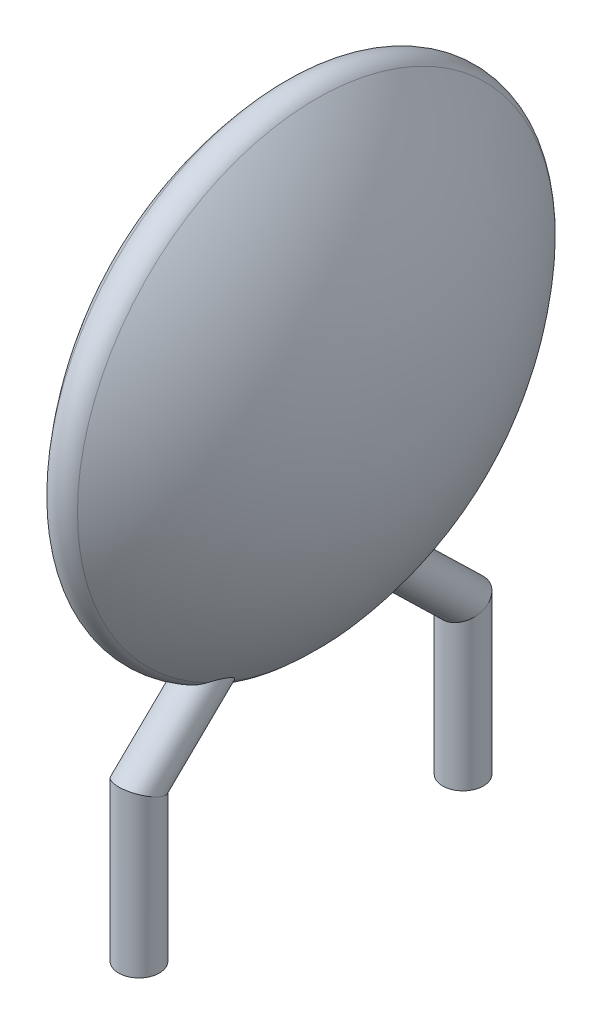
ISO-10303-21;
HEADER;
FILE_DESCRIPTION(('STEP AP214'),'2;1');
FILE_NAME('part.step','',(''),(''),'','','');
FILE_SCHEMA(('AUTOMOTIVE_DESIGN { 1 0 10303 214 1 1 1 1 }'));
ENDSEC;
DATA;
#1=APPLICATION_CONTEXT('core data for automotive mechanical design processes');
#2=APPLICATION_PROTOCOL_DEFINITION('international standard','automotive_design',2000,#1);
#3=PRODUCT_CONTEXT('',#1,'mechanical');
#4=PRODUCT('Part','Part','',(#3));
#5=PRODUCT_RELATED_PRODUCT_CATEGORY('part','',(#4));
#6=PRODUCT_DEFINITION_FORMATION('','',#4);
#7=PRODUCT_DEFINITION_CONTEXT('part definition',#1,'design');
#8=PRODUCT_DEFINITION('design','',#6,#7);
#9=PRODUCT_DEFINITION_SHAPE('','',#8);
#10=(LENGTH_UNIT() NAMED_UNIT(*) SI_UNIT(.MILLI.,.METRE.));
#11=(NAMED_UNIT(*) PLANE_ANGLE_UNIT() SI_UNIT($,.RADIAN.));
#12=(NAMED_UNIT(*) SI_UNIT($,.STERADIAN.) SOLID_ANGLE_UNIT());
#13=UNCERTAINTY_MEASURE_WITH_UNIT(LENGTH_MEASURE(1.E-05),#10,'distance_accuracy_value','');
#14=(GEOMETRIC_REPRESENTATION_CONTEXT(3) GLOBAL_UNCERTAINTY_ASSIGNED_CONTEXT((#13)) GLOBAL_UNIT_ASSIGNED_CONTEXT((#10,
#11,#12)) REPRESENTATION_CONTEXT('',''));
#15=CARTESIAN_POINT('',(0.,0.,0.));
#16=DIRECTION('',(0.,0.,1.));
#17=DIRECTION('',(1.,0.,0.));
#18=AXIS2_PLACEMENT_3D('',#15,#16,#17);
#19=CARTESIAN_POINT('',(0.,0.,0.));
#20=DIRECTION('',(-1.,0.,0.));
#21=DIRECTION('',(0.,0.,1.));
#22=AXIS2_PLACEMENT_3D('',#19,#20,#21);
#23=TOROIDAL_SURFACE('',#22,2.20793122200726,0.2);
#24=CARTESIAN_POINT('',(0.150141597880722,0.,0.));
#25=DIRECTION('',(-1.,0.,0.));
#26=DIRECTION('',(0.,0.,1.));
#27=AXIS2_PLACEMENT_3D('',#24,#25,#26);
#28=CIRCLE('',#27,2.34005805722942);
#29=CARTESIAN_POINT('',(0.150141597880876,-2.19487026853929,-0.811428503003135));
#30=VERTEX_POINT('',#29);
#31=CARTESIAN_POINT('',(0.150141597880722,-2.31765045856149,-0.32306046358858));
#32=VERTEX_POINT('',#31);
#33=EDGE_CURVE('E103',#30,#32,#28,.T.);
#34=ORIENTED_EDGE('',*,*,#33,.T.);
#35=CARTESIAN_POINT('',(1.01821764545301E-13,-2.31765045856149,0.653168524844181));
#36=CARTESIAN_POINT('',(0.00358224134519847,-2.31765045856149,0.653168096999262));
#37=CARTESIAN_POINT('',(0.00716594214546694,-2.31765045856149,0.652809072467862));
#38=CARTESIAN_POINT('',(0.0142016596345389,-2.31765045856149,0.651420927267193));
#39=CARTESIAN_POINT('',(0.0176534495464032,-2.31765045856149,0.650390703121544));
#40=CARTESIAN_POINT('',(0.025044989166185,-2.31765045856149,0.647497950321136));
#41=CARTESIAN_POINT('',(0.0289328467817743,-2.31765045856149,0.645505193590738));
#42=CARTESIAN_POINT('',(0.0363384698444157,-2.31765045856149,0.640926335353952));
#43=CARTESIAN_POINT('',(0.0398554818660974,-2.31765045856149,0.638339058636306));
#44=CARTESIAN_POINT('',(0.0488380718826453,-2.31765045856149,0.630827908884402));
#45=CARTESIAN_POINT('',(0.0539793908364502,-2.31765045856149,0.625521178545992));
#46=CARTESIAN_POINT('',(0.0634641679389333,-2.31765045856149,0.614245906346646));
#47=CARTESIAN_POINT('',(0.067805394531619,-2.31765045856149,0.60827558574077));
#48=CARTESIAN_POINT('',(0.077426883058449,-2.31765045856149,0.593551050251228));
#49=CARTESIAN_POINT('',(0.0824217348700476,-2.31765045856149,0.584612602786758));
#50=CARTESIAN_POINT('',(0.0915541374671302,-2.31765045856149,0.566301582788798));
#51=CARTESIAN_POINT('',(0.0956898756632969,-2.31765045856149,0.556928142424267));
#52=CARTESIAN_POINT('',(0.107155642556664,-2.31765045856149,0.52833750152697));
#53=CARTESIAN_POINT('',(0.113498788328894,-2.31765045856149,0.508729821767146));
#54=CARTESIAN_POINT('',(0.129093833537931,-2.31765045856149,0.452807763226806));
#55=CARTESIAN_POINT('',(0.136454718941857,-2.31765045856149,0.416000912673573));
#56=CARTESIAN_POINT('',(0.148232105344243,-2.31765045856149,0.341874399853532));
#57=CARTESIAN_POINT('',(0.152640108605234,-2.31765045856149,0.304553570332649));
#58=CARTESIAN_POINT('',(0.159510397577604,-2.31765045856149,0.229689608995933));
#59=CARTESIAN_POINT('',(0.161970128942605,-2.31765045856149,0.192146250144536));
#60=CARTESIAN_POINT('',(0.165474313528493,-2.31765045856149,0.117047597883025));
#61=CARTESIAN_POINT('',(0.166520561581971,-2.31765045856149,0.0794923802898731));
#62=CARTESIAN_POINT('',(0.167359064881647,-2.31765045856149,0.00910402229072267));
#63=CARTESIAN_POINT('',(0.167292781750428,-2.31765045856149,-0.0237275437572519));
#64=CARTESIAN_POINT('',(0.166232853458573,-2.31765045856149,-0.0893753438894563));
#65=CARTESIAN_POINT('',(0.165239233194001,-2.31765045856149,-0.122191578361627));
#66=CARTESIAN_POINT('',(0.162171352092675,-2.31765045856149,-0.187726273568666));
#67=CARTESIAN_POINT('',(0.160098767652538,-2.31765045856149,-0.220444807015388));
#68=CARTESIAN_POINT('',(0.154533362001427,-2.31765045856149,-0.285743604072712));
#69=CARTESIAN_POINT('',(0.151041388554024,-2.31765045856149,-0.318323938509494));
#70=CARTESIAN_POINT('',(0.142011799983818,-2.31765045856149,-0.383373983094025));
#71=CARTESIAN_POINT('',(0.136465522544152,-2.31765045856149,-0.415842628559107));
#72=CARTESIAN_POINT('',(0.125663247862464,-2.31765045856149,-0.464016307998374));
#73=CARTESIAN_POINT('',(0.121645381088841,-2.31765045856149,-0.479995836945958));
#74=CARTESIAN_POINT('',(0.112484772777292,-2.31765045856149,-0.511623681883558));
#75=CARTESIAN_POINT('',(0.107343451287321,-2.31765045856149,-0.527272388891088));
#76=CARTESIAN_POINT('',(0.0964396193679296,-2.31765045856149,-0.555404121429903));
#77=CARTESIAN_POINT('',(0.0909218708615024,-2.31765045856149,-0.567981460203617));
#78=CARTESIAN_POINT('',(0.0782918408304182,-2.31765045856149,-0.592282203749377));
#79=CARTESIAN_POINT('',(0.0711907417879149,-2.31765045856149,-0.604010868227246));
#80=CARTESIAN_POINT('',(0.0600732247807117,-2.31765045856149,-0.618347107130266));
#81=CARTESIAN_POINT('',(0.0571698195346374,-2.31765045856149,-0.621808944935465));
#82=CARTESIAN_POINT('',(0.0510287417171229,-2.31765045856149,-0.628436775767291));
#83=CARTESIAN_POINT('',(0.0477906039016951,-2.31765045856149,-0.631602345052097));
#84=CARTESIAN_POINT('',(0.0409023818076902,-2.31765045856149,-0.63753622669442));
#85=CARTESIAN_POINT('',(0.0372483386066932,-2.31765045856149,-0.640300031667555));
#86=CARTESIAN_POINT('',(0.0295326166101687,-2.31765045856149,-0.645186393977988));
#87=CARTESIAN_POINT('',(0.0254720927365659,-2.31765045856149,-0.647310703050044));
#88=CARTESIAN_POINT('',(0.0182532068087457,-2.31765045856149,-0.65016916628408));
#89=CARTESIAN_POINT('',(0.015184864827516,-2.31765045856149,-0.651128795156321));
#90=CARTESIAN_POINT('',(0.00893122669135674,-2.31765045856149,-0.652523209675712));
#91=CARTESIAN_POINT('',(0.00574606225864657,-2.31765045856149,-0.652958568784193));
#92=CARTESIAN_POINT('',(-0.000661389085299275,-2.31765045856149,-0.653259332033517));
#93=CARTESIAN_POINT('',(-0.00388375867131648,-2.31765045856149,-0.653123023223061));
#94=CARTESIAN_POINT('',(-0.0102559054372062,-2.31765045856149,-0.652292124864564));
#95=CARTESIAN_POINT('',(-0.0134056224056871,-2.31765045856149,-0.65159708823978));
#96=CARTESIAN_POINT('',(-0.0202341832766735,-2.31765045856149,-0.649508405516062));
#97=CARTESIAN_POINT('',(-0.0238756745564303,-2.31765045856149,-0.647994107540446));
#98=CARTESIAN_POINT('',(-0.0308660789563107,-2.31765045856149,-0.644399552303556));
#99=CARTESIAN_POINT('',(-0.0342144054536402,-2.31765045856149,-0.642318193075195));
#100=CARTESIAN_POINT('',(-0.0425400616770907,-2.31765045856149,-0.636363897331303));
#101=CARTESIAN_POINT('',(-0.0472831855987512,-2.31765045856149,-0.632167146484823));
#102=CARTESIAN_POINT('',(-0.0561067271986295,-2.31765045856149,-0.62313327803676));
#103=CARTESIAN_POINT('',(-0.0601853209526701,-2.31765045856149,-0.618294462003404));
#104=CARTESIAN_POINT('',(-0.073688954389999,-2.31765045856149,-0.600489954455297));
#105=CARTESIAN_POINT('',(-0.0816929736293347,-2.31765045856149,-0.586467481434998));
#106=CARTESIAN_POINT('',(-0.0957129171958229,-2.31765045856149,-0.557467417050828));
#107=CARTESIAN_POINT('',(-0.101716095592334,-2.31765045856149,-0.542484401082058));
#108=CARTESIAN_POINT('',(-0.115943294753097,-2.31765045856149,-0.501886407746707));
#109=CARTESIAN_POINT('',(-0.122972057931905,-2.31765045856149,-0.475855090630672));
#110=CARTESIAN_POINT('',(-0.1348313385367,-2.31765045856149,-0.423282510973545));
#111=CARTESIAN_POINT('',(-0.139655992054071,-2.31765045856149,-0.396740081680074));
#112=CARTESIAN_POINT('',(-0.147794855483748,-2.31765045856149,-0.343405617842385));
#113=CARTESIAN_POINT('',(-0.151107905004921,-2.31765045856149,-0.31661340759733));
#114=CARTESIAN_POINT('',(-0.15663657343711,-2.31765045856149,-0.262913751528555));
#115=CARTESIAN_POINT('',(-0.158851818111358,-2.31765045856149,-0.23600626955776));
#116=CARTESIAN_POINT('',(-0.163783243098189,-2.31765045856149,-0.162086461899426));
#117=CARTESIAN_POINT('',(-0.16564487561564,-2.31765045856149,-0.115017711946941));
#118=CARTESIAN_POINT('',(-0.167473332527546,-2.31765045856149,-0.0209526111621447));
#119=CARTESIAN_POINT('',(-0.167444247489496,-2.31765045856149,0.0260436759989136));
#120=CARTESIAN_POINT('',(-0.165780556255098,-2.31765045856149,0.105226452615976));
#121=CARTESIAN_POINT('',(-0.164653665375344,-2.31765045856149,0.137423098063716));
#122=CARTESIAN_POINT('',(-0.16131189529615,-2.31765045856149,0.201776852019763));
#123=CARTESIAN_POINT('',(-0.159096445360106,-2.31765045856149,0.233933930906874));
#124=CARTESIAN_POINT('',(-0.152156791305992,-2.31765045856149,0.310178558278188));
#125=CARTESIAN_POINT('',(-0.146803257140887,-2.31765045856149,0.354216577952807));
#126=CARTESIAN_POINT('',(-0.133870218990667,-2.31765045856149,0.428329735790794));
#127=CARTESIAN_POINT('',(-0.127458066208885,-2.31765045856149,0.458589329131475));
#128=CARTESIAN_POINT('',(-0.114864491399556,-2.31765045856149,0.503874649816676));
#129=CARTESIAN_POINT('',(-0.110038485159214,-2.31765045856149,0.519266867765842));
#130=CARTESIAN_POINT('',(-0.098961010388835,-2.31765045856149,0.549498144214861));
#131=CARTESIAN_POINT('',(-0.0927135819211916,-2.31765045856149,0.564338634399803));
#132=CARTESIAN_POINT('',(-0.0793841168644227,-2.31765045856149,0.590324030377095));
#133=CARTESIAN_POINT('',(-0.0726710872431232,-2.31765045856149,0.601644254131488));
#134=CARTESIAN_POINT('',(-0.0608805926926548,-2.31765045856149,0.61745662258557));
#135=CARTESIAN_POINT('',(-0.0566343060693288,-2.31765045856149,0.622558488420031));
#136=CARTESIAN_POINT('',(-0.0474159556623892,-2.31765045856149,0.632063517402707));
#137=CARTESIAN_POINT('',(-0.0424465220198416,-2.31765045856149,0.636469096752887));
#138=CARTESIAN_POINT('',(-0.034077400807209,-2.31765045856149,0.642393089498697));
#139=CARTESIAN_POINT('',(-0.030970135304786,-2.31765045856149,0.644321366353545));
#140=CARTESIAN_POINT('',(-0.0245020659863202,-2.31765045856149,0.647693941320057));
#141=CARTESIAN_POINT('',(-0.0211416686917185,-2.31765045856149,0.64913899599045));
#142=CARTESIAN_POINT('',(-0.0148299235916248,-2.31765045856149,0.651212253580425));
#143=CARTESIAN_POINT('',(-0.0119115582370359,-2.31765045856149,0.651939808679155));
#144=CARTESIAN_POINT('',(-0.00599577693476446,-2.31765045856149,0.652918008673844));
#145=CARTESIAN_POINT('',(-0.0029983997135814,-2.31765045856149,0.653168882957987));
#146=CARTESIAN_POINT('',(1.01821764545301E-13,-2.31765045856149,0.653168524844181));
#147=B_SPLINE_CURVE_WITH_KNOTS('',3,(#35,#36,#37,#38,#39,#40,#41,#42,#43,#44,#45,#46,#47,#48,
#49,#50,#51,#52,#53,#54,#55,#56,#57,#58,#59,#60,#61,#62,#63,#64,#65,#66,#67,#68,#69,#70,#71,#72,
#73,#74,#75,#76,#77,#78,#79,#80,#81,#82,#83,#84,#85,#86,#87,#88,#89,#90,#91,#92,#93,#94,#95,#96,
#97,#98,#99,#100,#101,#102,#103,#104,#105,#106,#107,#108,#109,#110,#111,#112,#113,#114,#115,
#116,#117,#118,#119,#120,#121,#122,#123,#124,#125,#126,#127,#128,#129,#130,#131,#132,#133,#134,
#135,#136,#137,#138,#139,#140,#141,#142,#143,#144,#145,#146),.UNSPECIFIED.,.T.,.F.,(4,2,2,2,2,2,
2,2,2,2,2,2,2,2,2,2,2,2,2,2,2,2,2,2,2,2,2,2,2,2,2,2,2,2,2,2,2,2,2,2,2,2,2,2,2,2,2,2,2,2,2,2,2,2,
2,4),(0.,0.0107326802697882,0.0214830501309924,0.0345147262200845,0.047572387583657,
0.0696142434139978,0.0917166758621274,0.122360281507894,0.15306789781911,0.214755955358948,
0.327119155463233,0.439804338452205,0.552637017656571,0.665326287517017,0.76380888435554,
0.862288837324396,0.960616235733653,1.05888499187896,1.15757292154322,1.2069788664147,
1.25632271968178,1.29747612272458,1.33834759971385,1.35188568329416,1.36544284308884,
1.37914197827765,1.39280323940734,1.40240903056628,1.4120043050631,1.42162835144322,
1.43126010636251,1.44302554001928,1.45481400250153,1.47370607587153,1.49264915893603,
1.54071662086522,1.58908468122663,1.669762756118,1.75065423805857,1.83160771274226,
1.91258876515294,2.05384944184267,2.19480451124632,2.29143770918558,2.38812162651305,
2.52107284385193,2.61370631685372,2.66205108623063,2.71026012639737,2.7495384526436,
2.7694060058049,2.78920302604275,2.80014278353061,2.81106533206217,2.82005310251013,
2.82903654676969),.UNSPECIFIED.);
#148=CARTESIAN_POINT('',(-0.150141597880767,-2.31765045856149,-0.323060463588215));
#149=VERTEX_POINT('',#148);
#150=EDGE_CURVE('E49',#32,#149,#147,.T.);
#151=ORIENTED_EDGE('',*,*,#150,.T.);
#152=CARTESIAN_POINT('',(-0.150141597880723,0.,0.));
#153=DIRECTION('',(-1.,0.,0.));
#154=DIRECTION('',(0.,0.,1.));
#155=AXIS2_PLACEMENT_3D('',#152,#153,#154);
#156=CIRCLE('',#155,2.34005805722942);
#157=CARTESIAN_POINT('',(-0.150141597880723,-2.19487026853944,-0.811428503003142));
#158=VERTEX_POINT('',#157);
#159=EDGE_CURVE('E115',#158,#149,#156,.T.);
#160=ORIENTED_EDGE('',*,*,#159,.F.);
#161=CARTESIAN_POINT('',(0.197950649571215,-2.07435108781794,-0.836032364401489));
#162=CARTESIAN_POINT('',(0.195909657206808,-2.09103306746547,-0.832756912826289));
#163=CARTESIAN_POINT('',(0.192278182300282,-2.10759376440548,-0.829445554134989));
#164=CARTESIAN_POINT('',(0.181882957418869,-2.13958360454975,-0.822956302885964));
#165=CARTESIAN_POINT('',(0.175141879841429,-2.15502001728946,-0.819777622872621));
#166=CARTESIAN_POINT('',(0.164370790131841,-2.17391593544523,-0.815837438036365));
#167=CARTESIAN_POINT('',(0.161759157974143,-2.1781767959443,-0.814945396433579));
#168=CARTESIAN_POINT('',(0.156258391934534,-2.18652681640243,-0.813191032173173));
#169=CARTESIAN_POINT('',(0.153369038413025,-2.19061583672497,-0.812328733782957));
#170=CARTESIAN_POINT('',(0.143567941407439,-2.20353689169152,-0.809594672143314));
#171=CARTESIAN_POINT('',(0.136103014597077,-2.21197688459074,-0.807794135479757));
#172=CARTESIAN_POINT('',(0.119869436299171,-2.22757652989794,-0.804445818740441));
#173=CARTESIAN_POINT('',(0.111099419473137,-2.23473482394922,-0.80289830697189));
#174=CARTESIAN_POINT('',(0.0923573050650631,-2.24748794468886,-0.800128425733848));
#175=CARTESIAN_POINT('',(0.082378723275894,-2.25307375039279,-0.79890793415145));
#176=CARTESIAN_POINT('',(0.0615269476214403,-2.26231521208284,-0.796882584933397));
#177=CARTESIAN_POINT('',(0.050654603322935,-2.2659726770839,-0.796077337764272));
#178=CARTESIAN_POINT('',(0.0294749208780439,-2.27087659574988,-0.794996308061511));
#179=CARTESIAN_POINT('',(0.0192161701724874,-2.27232370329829,-0.794676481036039));
#180=CARTESIAN_POINT('',(-0.00139864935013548,-2.27337808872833,-0.794443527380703));
#181=CARTESIAN_POINT('',(-0.0117546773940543,-2.27298610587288,-0.794530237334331));
#182=CARTESIAN_POINT('',(-0.0315169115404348,-2.27047717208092,-0.795084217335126));
#183=CARTESIAN_POINT('',(-0.0409395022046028,-2.26848054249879,-0.795524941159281));
#184=CARTESIAN_POINT('',(-0.0593235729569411,-2.26301247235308,-0.796728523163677));
#185=CARTESIAN_POINT('',(-0.0682849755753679,-2.25954078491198,-0.797491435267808));
#186=CARTESIAN_POINT('',(-0.0857957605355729,-2.25115214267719,-0.799327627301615));
#187=CARTESIAN_POINT('',(-0.0943251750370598,-2.2461955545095,-0.800409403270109));
#188=CARTESIAN_POINT('',(-0.110510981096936,-2.23508451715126,-0.802822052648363));
#189=CARTESIAN_POINT('',(-0.11816758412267,-2.22893035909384,-0.804152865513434));
#190=CARTESIAN_POINT('',(-0.134481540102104,-2.21379301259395,-0.807406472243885));
#191=CARTESIAN_POINT('',(-0.142839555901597,-2.20449648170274,-0.809391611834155));
#192=CARTESIAN_POINT('',(-0.15176075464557,-2.19273620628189,-0.811880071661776));
#193=CARTESIAN_POINT('',(-0.153149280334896,-2.19084419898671,-0.81227977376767));
#194=CARTESIAN_POINT('',(-0.168203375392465,-2.16964427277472,-0.816750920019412));
#195=CARTESIAN_POINT('',(-0.178794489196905,-2.14828213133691,-0.821188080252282));
#196=CARTESIAN_POINT('',(-0.186388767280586,-2.1256896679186,-0.825774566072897));
#197=B_SPLINE_CURVE_WITH_KNOTS('',3,(#161,#162,#163,#164,#165,#166,#167,#168,#169,#170,#171,
#172,#173,#174,#175,#176,#177,#178,#179,#180,#181,#182,#183,#184,#185,#186,#187,#188,#189,#190,
#191,#192,#193,#194,#195,#196),.UNSPECIFIED.,.F.,.F.,(4,2,2,2,2,2,2,2,2,2,2,2,2,2,2,2,2,4),(0.,
0.0514341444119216,0.102499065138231,0.117720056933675,0.132953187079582,0.167036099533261,
0.201154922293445,0.235465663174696,0.269744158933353,0.300673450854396,0.33159031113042,
0.360383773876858,0.389182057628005,0.418830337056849,0.44847141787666,0.48622222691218,
0.493363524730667,0.565387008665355),.UNSPECIFIED.);
#198=EDGE_CURVE('E146',#30,#158,#197,.T.);
#199=ORIENTED_EDGE('',*,*,#198,.F.);
#200=EDGE_LOOP('',(#34,#151,#160,#199));
#201=FACE_BOUND('',#200,.T.);
#202=ADVANCED_FACE('F29',(#201),#23,.T.);
#203=CARTESIAN_POINT('',(-0.150141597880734,-2.31765045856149,0.323060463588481));
#204=VERTEX_POINT('',#203);
#205=CARTESIAN_POINT('',(-0.1501415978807,-2.19487026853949,0.811428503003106));
#206=VERTEX_POINT('',#205);
#207=EDGE_CURVE('E98',#204,#206,#156,.T.);
#208=ORIENTED_EDGE('',*,*,#207,.F.);
#209=CARTESIAN_POINT('',(0.150141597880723,-2.31765045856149,0.323060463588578));
#210=VERTEX_POINT('',#209);
#211=EDGE_CURVE('E92',#204,#210,#147,.T.);
#212=ORIENTED_EDGE('',*,*,#211,.T.);
#213=CARTESIAN_POINT('',(0.150141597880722,-2.19487026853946,0.811428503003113));
#214=VERTEX_POINT('',#213);
#215=EDGE_CURVE('E56',#210,#214,#28,.T.);
#216=ORIENTED_EDGE('',*,*,#215,.T.);
#217=CARTESIAN_POINT('',(0.163199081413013,-2.17575015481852,0.815452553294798));
#218=CARTESIAN_POINT('',(0.159237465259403,-2.18223415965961,0.814095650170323));
#219=CARTESIAN_POINT('',(0.15494784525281,-2.188535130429,0.812769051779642));
#220=CARTESIAN_POINT('',(0.143563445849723,-2.20354182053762,0.809593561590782));
#221=CARTESIAN_POINT('',(0.136099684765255,-2.21198055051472,0.807793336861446));
#222=CARTESIAN_POINT('',(0.119867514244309,-2.22757791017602,0.804445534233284));
#223=CARTESIAN_POINT('',(0.111098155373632,-2.23473559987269,0.802898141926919));
#224=CARTESIAN_POINT('',(0.0923574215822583,-2.24748795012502,0.800128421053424));
#225=CARTESIAN_POINT('',(0.0823794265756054,-2.25307338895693,0.798908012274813));
#226=CARTESIAN_POINT('',(0.0615278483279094,-2.26231486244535,0.796882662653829));
#227=CARTESIAN_POINT('',(0.0506550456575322,-2.26597255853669,0.796077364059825));
#228=CARTESIAN_POINT('',(0.0294747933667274,-2.27087663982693,0.794996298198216));
#229=CARTESIAN_POINT('',(0.0192159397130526,-2.27232374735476,0.794676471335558));
#230=CARTESIAN_POINT('',(-0.00139888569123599,-2.2733780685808,0.794443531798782));
#231=CARTESIAN_POINT('',(-0.0117548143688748,-2.27298606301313,0.794530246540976));
#232=CARTESIAN_POINT('',(-0.0315166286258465,-2.27047723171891,0.795084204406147));
#233=CARTESIAN_POINT('',(-0.0409389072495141,-2.26848074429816,0.795524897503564));
#234=CARTESIAN_POINT('',(-0.0593231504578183,-2.26301257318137,0.796728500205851));
#235=CARTESIAN_POINT('',(-0.0682850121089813,-2.25954056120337,0.797491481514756));
#236=CARTESIAN_POINT('',(-0.0857966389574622,-2.25115193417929,0.79932767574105));
#237=CARTESIAN_POINT('',(-0.0943263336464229,-2.24619557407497,0.800409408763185));
#238=CARTESIAN_POINT('',(-0.110514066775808,-2.2350815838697,0.802822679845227));
#239=CARTESIAN_POINT('',(-0.118172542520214,-2.22892456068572,0.804154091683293));
#240=CARTESIAN_POINT('',(-0.129914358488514,-2.21803155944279,0.806495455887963));
#241=CARTESIAN_POINT('',(-0.134287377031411,-2.21358942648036,0.80744700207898));
#242=CARTESIAN_POINT('',(-0.142623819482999,-2.20435219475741,0.809417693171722));
#243=CARTESIAN_POINT('',(-0.146587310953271,-2.19955715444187,0.810436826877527));
#244=CARTESIAN_POINT('',(-0.159485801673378,-2.18255003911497,0.814035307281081));
#245=CARTESIAN_POINT('',(-0.16738890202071,-2.16957283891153,0.816754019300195));
#246=CARTESIAN_POINT('',(-0.180674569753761,-2.1423555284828,0.82238488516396));
#247=CARTESIAN_POINT('',(-0.186047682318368,-2.12811091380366,0.82529771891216));
#248=CARTESIAN_POINT('',(-0.1901069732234,-2.11357300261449,0.82822578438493));
#249=B_SPLINE_CURVE_WITH_KNOTS('',3,(#217,#218,#219,#220,#221,#222,#223,#224,#225,#226,#227,
#228,#229,#230,#231,#232,#233,#234,#235,#236,#237,#238,#239,#240,#241,#242,#243,#244,#245,#246,
#247,#248),.UNSPECIFIED.,.F.,.F.,(4,2,2,2,2,2,2,2,2,2,2,2,2,2,2,4),(0.,0.0231655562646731,
0.0572539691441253,0.0913672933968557,0.125676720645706,0.15995652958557,0.190886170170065,
0.221802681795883,0.250595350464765,0.279394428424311,0.309046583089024,0.338683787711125,
0.357578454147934,0.37646999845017,0.422483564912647,0.468667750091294),.UNSPECIFIED.);
#250=EDGE_CURVE('E166',#214,#206,#249,.T.);
#251=ORIENTED_EDGE('',*,*,#250,.T.);
#252=EDGE_LOOP('',(#208,#212,#216,#251));
#253=FACE_BOUND('',#252,.T.);
#254=ADVANCED_FACE('F97',(#253),#23,.T.);
#255=CARTESIAN_POINT('',(2.41228209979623,0.,0.0850871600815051));
#256=DIRECTION('',(0.,-1.,0.));
#257=DIRECTION('',(0.,0.,1.));
#258=AXIS2_PLACEMENT_3D('',#255,#256,#257);
#259=CIRCLE('',#258,3.41334278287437);
#260=TRIMMED_CURVE('',#259,(PARAMETER_VALUE(-1.59572671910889)),
(PARAMETER_VALUE(1.59572671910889)),.T.,.PARAMETER.);
#261=CARTESIAN_POINT('',(2.41228209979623,0.,0.));
#262=DIRECTION('',(-1.,0.,0.));
#263=AXIS1_PLACEMENT('',#261,#262);
#264=SURFACE_OF_REVOLUTION('',#260,#263);
#265=CARTESIAN_POINT('',(-1.,0.,0.));
#266=VERTEX_POINT('',#265);
#267=VERTEX_LOOP('',#266);
#268=FACE_BOUND('',#267,.T.);
#269=ORIENTED_EDGE('',*,*,#159,.T.);
#270=CARTESIAN_POINT('',(-0.169590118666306,-2.31765045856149,0.0229172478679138));
#271=CARTESIAN_POINT('',(-0.168300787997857,-2.31765045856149,0.173044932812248));
#272=CARTESIAN_POINT('',(-0.15437434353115,-2.31765045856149,0.323177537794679));
#273=CARTESIAN_POINT('',(-0.101480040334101,-2.31765045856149,0.619103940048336));
#274=CARTESIAN_POINT('',(-0.0624817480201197,-2.31765045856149,0.764892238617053));
#275=CARTESIAN_POINT('',(0.0395984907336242,-2.31765045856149,1.04752094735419));
#276=CARTESIAN_POINT('',(0.102638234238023,-2.31765045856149,1.18437654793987));
#277=CARTESIAN_POINT('',(0.251184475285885,-2.31765045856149,1.44525021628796));
#278=CARTESIAN_POINT('',(0.33668309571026,-2.31765045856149,1.56927276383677));
#279=CARTESIAN_POINT('',(0.526122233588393,-2.31765045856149,1.79869758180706));
#280=CARTESIAN_POINT('',(0.629715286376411,-2.31765045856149,1.90438675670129));
#281=CARTESIAN_POINT('',(0.853416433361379,-2.31765045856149,2.09655217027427));
#282=CARTESIAN_POINT('',(0.973523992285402,-2.31765045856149,2.18302903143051));
#283=CARTESIAN_POINT('',(1.2248791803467,-2.31765045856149,2.33299985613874));
#284=CARTESIAN_POINT('',(1.35593345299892,-2.31765045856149,2.39681804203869));
#285=CARTESIAN_POINT('',(1.62695076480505,-2.31765045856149,2.50135526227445));
#286=CARTESIAN_POINT('',(1.76691332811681,-2.31765045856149,2.54207552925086));
#287=CARTESIAN_POINT('',(2.05063921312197,-2.31765045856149,2.59898902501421));
#288=CARTESIAN_POINT('',(2.19436598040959,-2.31765045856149,2.61536462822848));
#289=CARTESIAN_POINT('',(2.48252386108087,-2.31765045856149,2.62368893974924));
#290=CARTESIAN_POINT('',(2.6269549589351,-2.31765045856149,2.61563818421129));
#291=CARTESIAN_POINT('',(2.91205179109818,-2.31765045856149,2.57539704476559));
#292=CARTESIAN_POINT('',(3.05272585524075,-2.31765045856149,2.54326562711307));
#293=CARTESIAN_POINT('',(3.32669343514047,-2.31765045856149,2.45587349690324));
#294=CARTESIAN_POINT('',(3.45998696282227,-2.31765045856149,2.40061282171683));
#295=CARTESIAN_POINT('',(3.7156323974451,-2.31765045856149,2.26848113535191));
#296=CARTESIAN_POINT('',(3.83796839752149,-2.31765045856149,2.19157935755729));
#297=CARTESIAN_POINT('',(4.06808639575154,-2.31765045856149,2.01844165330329));
#298=CARTESIAN_POINT('',(4.17586824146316,-2.31765045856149,1.92220552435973));
#299=CARTESIAN_POINT('',(4.37454694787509,-2.31765045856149,1.71255817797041));
#300=CARTESIAN_POINT('',(4.46533956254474,-2.31765045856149,1.59904820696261));
#301=CARTESIAN_POINT('',(4.62685199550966,-2.31765045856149,1.35855617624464));
#302=CARTESIAN_POINT('',(4.69757082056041,-2.31765045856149,1.2315734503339));
#303=CARTESIAN_POINT('',(4.81794566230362,-2.31765045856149,0.966056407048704));
#304=CARTESIAN_POINT('',(4.86732443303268,-2.31765045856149,0.827396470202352));
#305=CARTESIAN_POINT('',(4.94257722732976,-2.31765045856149,0.543834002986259));
#306=CARTESIAN_POINT('',(4.96844778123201,-2.31765045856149,0.398930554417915));
#307=CARTESIAN_POINT('',(4.99639432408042,-2.31765045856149,0.104154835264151));
#308=CARTESIAN_POINT('',(4.99802443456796,-2.31765045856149,-0.0457598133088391));
#309=CARTESIAN_POINT('',(4.97630708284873,-2.31765045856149,-0.34377550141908));
#310=CARTESIAN_POINT('',(4.95295863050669,-2.31765045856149,-0.491876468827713));
#311=CARTESIAN_POINT('',(4.88151006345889,-2.31765045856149,-0.783166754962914));
#312=CARTESIAN_POINT('',(4.83322756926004,-2.31765045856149,-0.926311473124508));
#313=CARTESIAN_POINT('',(4.7129653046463,-2.31765045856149,-1.20227800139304));
#314=CARTESIAN_POINT('',(4.64098757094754,-2.31765045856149,-1.33510069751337));
#315=CARTESIAN_POINT('',(4.47643729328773,-2.31765045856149,-1.58457513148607));
#316=CARTESIAN_POINT('',(4.38417559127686,-2.31765045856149,-1.70143183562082));
#317=CARTESIAN_POINT('',(4.18103026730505,-2.31765045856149,-1.91765422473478));
#318=CARTESIAN_POINT('',(4.07014808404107,-2.31765045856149,-2.01702125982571));
#319=CARTESIAN_POINT('',(3.83498147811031,-2.31765045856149,-2.193696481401));
#320=CARTESIAN_POINT('',(3.71095783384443,-2.31765045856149,-2.27135192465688));
#321=CARTESIAN_POINT('',(3.45153698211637,-2.31765045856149,-2.4045022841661));
#322=CARTESIAN_POINT('',(3.31614048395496,-2.31765045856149,-2.45999858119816));
#323=CARTESIAN_POINT('',(3.03922867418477,-2.31765045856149,-2.54674721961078));
#324=CARTESIAN_POINT('',(2.89778486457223,-2.31765045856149,-2.57822794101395));
#325=CARTESIAN_POINT('',(2.61161522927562,-2.31765045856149,-2.61689600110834));
#326=CARTESIAN_POINT('',(2.46688949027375,-2.31765045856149,-2.62408398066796));
#327=CARTESIAN_POINT('',(2.17885047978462,-2.31765045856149,-2.61397468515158));
#328=CARTESIAN_POINT('',(2.03553392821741,-2.31765045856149,-2.59677054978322));
#329=CARTESIAN_POINT('',(1.7538238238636,-2.31765045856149,-2.53854949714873));
#330=CARTESIAN_POINT('',(1.61543024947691,-2.31765045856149,-2.49753268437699));
#331=CARTESIAN_POINT('',(1.34744219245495,-2.31765045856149,-2.3928733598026));
#332=CARTESIAN_POINT('',(1.21785000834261,-2.31765045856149,-2.32922496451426));
#333=CARTESIAN_POINT('',(0.97113749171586,-2.31765045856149,-2.18116647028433));
#334=CARTESIAN_POINT('',(0.854016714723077,-2.31765045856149,-2.0967571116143));
#335=CARTESIAN_POINT('',(0.634996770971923,-2.31765045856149,-1.90922684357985));
#336=CARTESIAN_POINT('',(0.533164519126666,-2.31765045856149,-1.80602781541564));
#337=CARTESIAN_POINT('',(0.348039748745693,-2.31765045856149,-1.58412114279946));
#338=CARTESIAN_POINT('',(0.264752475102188,-2.31765045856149,-1.46540912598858));
#339=CARTESIAN_POINT('',(0.118103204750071,-2.31765045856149,-1.21455522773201));
#340=CARTESIAN_POINT('',(0.054965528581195,-2.31765045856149,-1.08228244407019));
#341=CARTESIAN_POINT('',(-0.0485662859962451,-2.31765045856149,-0.809241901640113));
#342=CARTESIAN_POINT('',(-0.0889846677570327,-2.31765045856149,-0.668483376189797));
#343=CARTESIAN_POINT('',(-0.135699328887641,-2.31765045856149,-0.435267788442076));
#344=CARTESIAN_POINT('',(-0.149084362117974,-2.31765045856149,-0.344167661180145));
#345=CARTESIAN_POINT('',(-0.16642496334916,-2.31765045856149,-0.161073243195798));
#346=CARTESIAN_POINT('',(-0.170380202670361,-2.31765045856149,-0.0690789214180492));
#347=CARTESIAN_POINT('',(-0.169590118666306,-2.31765045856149,0.0229172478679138));
#348=B_SPLINE_CURVE_WITH_KNOTS('',3,(#270,#271,#272,#273,#274,#275,#276,#277,#278,#279,#280,
#281,#282,#283,#284,#285,#286,#287,#288,#289,#290,#291,#292,#293,#294,#295,#296,#297,#298,#299,
#300,#301,#302,#303,#304,#305,#306,#307,#308,#309,#310,#311,#312,#313,#314,#315,#316,#317,#318,
#319,#320,#321,#322,#323,#324,#325,#326,#327,#328,#329,#330,#331,#332,#333,#334,#335,#336,#337,
#338,#339,#340,#341,#342,#343,#344,#345,#346,#347),.UNSPECIFIED.,.T.,.F.,(4,2,2,2,2,2,2,2,2,2,2,
2,2,2,2,2,2,2,2,2,2,2,2,2,2,2,2,2,2,2,2,2,2,2,2,2,2,2,4),(0.,0.450064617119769,
0.900676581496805,1.35050114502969,1.80016814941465,2.24199646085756,2.68381045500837,
3.11902028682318,3.55420689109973,3.98611663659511,4.41801690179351,4.84886301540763,
5.27970843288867,5.71116949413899,6.14263507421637,6.57666703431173,7.01072046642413,
7.45025488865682,7.88985417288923,8.33752964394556,8.78522286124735,9.23623810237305,
9.68721458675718,10.1317099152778,10.5761709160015,11.0130529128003,11.4499076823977,
11.8825544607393,12.3151898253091,12.746177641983,13.1771635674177,13.6082616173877,
14.0393442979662,14.472261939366,14.905301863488,15.3430069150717,15.7802440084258,
16.0560277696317,16.3318211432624),.UNSPECIFIED.);
#349=EDGE_CURVE('E225',#149,#204,#348,.T.);
#350=ORIENTED_EDGE('',*,*,#349,.T.);
#351=ORIENTED_EDGE('',*,*,#207,.T.);
#352=CARTESIAN_POINT('',(-0.046930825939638,-2.30537718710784,0.835749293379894));
#353=CARTESIAN_POINT('',(-0.0584511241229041,-2.29504302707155,0.829151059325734));
#354=CARTESIAN_POINT('',(-0.0700980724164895,-2.28405826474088,0.823408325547));
#355=CARTESIAN_POINT('',(-0.093374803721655,-2.2608216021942,0.814409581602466));
#356=CARTESIAN_POINT('',(-0.105002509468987,-2.2485554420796,0.81118591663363));
#357=CARTESIAN_POINT('',(-0.122178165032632,-2.22922679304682,0.808930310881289));
#358=CARTESIAN_POINT('',(-0.127946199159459,-2.22251741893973,0.808625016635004));
#359=CARTESIAN_POINT('',(-0.139194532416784,-2.20892680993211,0.80912477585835));
#360=CARTESIAN_POINT('',(-0.14467574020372,-2.20204623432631,0.809926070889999));
#361=CARTESIAN_POINT('',(-0.154486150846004,-2.18916669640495,0.812622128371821));
#362=CARTESIAN_POINT('',(-0.158870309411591,-2.18317607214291,0.81435207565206));
#363=CARTESIAN_POINT('',(-0.167180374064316,-2.17127329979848,0.818884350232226));
#364=CARTESIAN_POINT('',(-0.17110631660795,-2.1653611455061,0.821686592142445));
#365=CARTESIAN_POINT('',(-0.178364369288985,-2.15375385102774,0.828441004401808));
#366=CARTESIAN_POINT('',(-0.181692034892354,-2.14806056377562,0.83240124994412));
#367=CARTESIAN_POINT('',(-0.187564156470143,-2.13715147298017,0.841409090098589));
#368=CARTESIAN_POINT('',(-0.190109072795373,-2.13193539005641,0.846456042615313));
#369=CARTESIAN_POINT('',(-0.194171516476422,-2.12252517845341,0.857051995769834));
#370=CARTESIAN_POINT('',(-0.195751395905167,-2.11828388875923,0.862535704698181));
#371=CARTESIAN_POINT('',(-0.198164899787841,-2.11044419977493,0.874092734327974));
#372=CARTESIAN_POINT('',(-0.198998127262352,-2.10684614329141,0.880166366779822));
#373=CARTESIAN_POINT('',(-0.200116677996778,-2.09929612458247,0.894659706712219));
#374=CARTESIAN_POINT('',(-0.200151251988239,-2.09558168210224,0.903221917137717));
#375=CARTESIAN_POINT('',(-0.199196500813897,-2.08921235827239,0.92067677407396));
#376=CARTESIAN_POINT('',(-0.198204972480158,-2.08655977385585,0.929570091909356));
#377=CARTESIAN_POINT('',(-0.194722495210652,-2.08117370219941,0.951587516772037));
#378=CARTESIAN_POINT('',(-0.191749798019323,-2.07897167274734,0.96476354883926));
#379=CARTESIAN_POINT('',(-0.184446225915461,-2.0761699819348,0.990887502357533));
#380=CARTESIAN_POINT('',(-0.180113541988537,-2.07557246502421,1.00383509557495));
#381=CARTESIAN_POINT('',(-0.167911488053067,-2.07570455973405,1.0358098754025));
#382=CARTESIAN_POINT('',(-0.159364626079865,-2.07726485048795,1.05457575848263));
#383=CARTESIAN_POINT('',(-0.143133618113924,-2.08193276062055,1.0857580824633));
#384=CARTESIAN_POINT('',(-0.135868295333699,-2.08449080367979,1.09849133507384));
#385=CARTESIAN_POINT('',(-0.120546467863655,-2.09067997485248,1.12320871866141));
#386=CARTESIAN_POINT('',(-0.112489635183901,-2.09431154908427,1.13519253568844));
#387=CARTESIAN_POINT('',(-0.104101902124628,-2.09841516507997,1.14676768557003));
#388=B_SPLINE_CURVE_WITH_KNOTS('',3,(#352,#353,#354,#355,#356,#357,#358,#359,#360,#361,#362,
#363,#364,#365,#366,#367,#368,#369,#370,#371,#372,#373,#374,#375,#376,#377,#378,#379,#380,#381,
#382,#383,#384,#385,#386,#387),.UNSPECIFIED.,.F.,.F.,(4,2,2,2,2,2,2,2,2,2,2,2,2,2,2,2,2,4),(0.,
0.0506858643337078,0.102012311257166,0.128510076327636,0.15491806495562,0.17770874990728,
0.200497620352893,0.223449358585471,0.246387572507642,0.267619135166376,0.288861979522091,
0.316706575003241,0.344611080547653,0.385438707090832,0.426320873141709,0.488019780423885,
0.532596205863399,0.577191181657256),.UNSPECIFIED.);
#389=CARTESIAN_POINT('',(-0.150141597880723,-2.07991746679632,1.0722942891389));
#390=VERTEX_POINT('',#389);
#391=EDGE_CURVE('E171',#206,#390,#388,.T.);
#392=ORIENTED_EDGE('',*,*,#391,.T.);
#393=CARTESIAN_POINT('',(-0.150141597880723,-2.07991746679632,-1.0722942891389));
#394=VERTEX_POINT('',#393);
#395=EDGE_CURVE('E106',#390,#394,#156,.T.);
#396=ORIENTED_EDGE('',*,*,#395,.T.);
#397=CARTESIAN_POINT('',(-0.046930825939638,-2.30537718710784,-0.835749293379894));
#398=CARTESIAN_POINT('',(-0.0584511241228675,-2.29504302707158,-0.829151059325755));
#399=CARTESIAN_POINT('',(-0.0700980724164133,-2.28405826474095,-0.823408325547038));
#400=CARTESIAN_POINT('',(-0.0933748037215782,-2.26082160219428,-0.814409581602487));
#401=CARTESIAN_POINT('',(-0.105002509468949,-2.24855544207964,-0.811185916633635));
#402=CARTESIAN_POINT('',(-0.122178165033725,-2.22922679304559,-0.808930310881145));
#403=CARTESIAN_POINT('',(-0.127946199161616,-2.22251741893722,-0.808625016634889));
#404=CARTESIAN_POINT('',(-0.13919453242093,-2.208926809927,-0.809124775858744));
#405=CARTESIAN_POINT('',(-0.144675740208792,-2.20204623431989,-0.809926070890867));
#406=CARTESIAN_POINT('',(-0.154486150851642,-2.18916669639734,-0.812622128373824));
#407=CARTESIAN_POINT('',(-0.158870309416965,-2.18317607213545,-0.814352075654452));
#408=CARTESIAN_POINT('',(-0.16718037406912,-2.17127329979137,-0.818884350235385));
#409=CARTESIAN_POINT('',(-0.171106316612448,-2.16536114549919,-0.821686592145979));
#410=CARTESIAN_POINT('',(-0.178364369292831,-2.15375385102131,-0.828441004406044));
#411=CARTESIAN_POINT('',(-0.181692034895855,-2.14806056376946,-0.832401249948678));
#412=CARTESIAN_POINT('',(-0.187564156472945,-2.13715147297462,-0.841409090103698));
#413=CARTESIAN_POINT('',(-0.190109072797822,-2.13193539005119,-0.846456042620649));
#414=CARTESIAN_POINT('',(-0.194171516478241,-2.12252517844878,-0.857051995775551));
#415=CARTESIAN_POINT('',(-0.195751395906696,-2.11828388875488,-0.862535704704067));
#416=CARTESIAN_POINT('',(-0.198164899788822,-2.11044419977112,-0.874092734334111));
#417=CARTESIAN_POINT('',(-0.198998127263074,-2.10684614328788,-0.880166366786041));
#418=CARTESIAN_POINT('',(-0.200116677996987,-2.09929612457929,-0.894659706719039));
#419=CARTESIAN_POINT('',(-0.200151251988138,-2.0955816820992,-0.903221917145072));
#420=CARTESIAN_POINT('',(-0.199196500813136,-2.08921235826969,-0.920676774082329));
#421=CARTESIAN_POINT('',(-0.198204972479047,-2.08655977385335,-0.929570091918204));
#422=CARTESIAN_POINT('',(-0.194722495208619,-2.0811737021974,-0.951587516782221));
#423=CARTESIAN_POINT('',(-0.191749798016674,-2.07897167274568,-0.964763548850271));
#424=CARTESIAN_POINT('',(-0.184446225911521,-2.07616998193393,-0.990887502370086));
#425=CARTESIAN_POINT('',(-0.180113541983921,-2.07557246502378,-1.00383509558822));
#426=CARTESIAN_POINT('',(-0.167911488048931,-2.07570455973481,-1.03580987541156));
#427=CARTESIAN_POINT('',(-0.159364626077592,-2.0772648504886,-1.054575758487));
#428=CARTESIAN_POINT('',(-0.143133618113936,-2.08193276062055,-1.08575808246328));
#429=CARTESIAN_POINT('',(-0.135868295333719,-2.08449080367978,-1.09849133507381));
#430=CARTESIAN_POINT('',(-0.120546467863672,-2.09067997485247,-1.12320871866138));
#431=CARTESIAN_POINT('',(-0.112489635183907,-2.09431154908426,-1.13519253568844));
#432=CARTESIAN_POINT('',(-0.104101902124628,-2.09841516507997,-1.14676768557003));
#433=B_SPLINE_CURVE_WITH_KNOTS('',3,(#397,#398,#399,#400,#401,#402,#403,#404,#405,#406,#407,
#408,#409,#410,#411,#412,#413,#414,#415,#416,#417,#418,#419,#420,#421,#422,#423,#424,#425,#426,
#427,#428,#429,#430,#431,#432),.UNSPECIFIED.,.F.,.F.,(4,2,2,2,2,2,2,2,2,2,2,2,2,2,2,2,2,4),(0.,
0.0506858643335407,0.102012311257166,0.128510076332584,0.154918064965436,0.177708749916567,
0.200497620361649,0.223449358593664,0.24638757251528,0.267619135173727,0.288861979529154,
0.316706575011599,0.344611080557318,0.38543870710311,0.426320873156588,0.488019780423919,
0.532596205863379,0.577191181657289),.UNSPECIFIED.);
#434=EDGE_CURVE('E107',#158,#394,#433,.T.);
#435=ORIENTED_EDGE('',*,*,#434,.F.);
#436=EDGE_LOOP('',(#269,#350,#351,#392,#396,#435));
#437=FACE_BOUND('',#436,.T.);
#438=ADVANCED_FACE('F31',(#268,#437),#264,.T.);
#439=ORIENTED_EDGE('',*,*,#395,.F.);
#440=CARTESIAN_POINT('',(-0.2,-2.040853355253,0.842542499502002));
#441=CARTESIAN_POINT('',(-0.199999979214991,-2.04103905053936,0.843508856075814));
#442=CARTESIAN_POINT('',(-0.199997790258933,-2.04122448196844,0.844475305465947));
#443=CARTESIAN_POINT('',(-0.199857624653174,-2.04716736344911,0.875496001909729));
#444=CARTESIAN_POINT('',(-0.197615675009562,-2.05266833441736,0.905628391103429));
#445=CARTESIAN_POINT('',(-0.188320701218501,-2.06304658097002,0.96527981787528));
#446=CARTESIAN_POINT('',(-0.181276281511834,-2.06792495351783,0.994799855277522));
#447=CARTESIAN_POINT('',(-0.168291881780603,-2.0737256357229,1.03161062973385));
#448=CARTESIAN_POINT('',(-0.165105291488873,-2.07500208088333,1.03983306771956));
#449=CARTESIAN_POINT('',(-0.158163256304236,-2.07748545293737,1.05605681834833));
#450=CARTESIAN_POINT('',(-0.154407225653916,-2.07869230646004,1.06405789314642));
#451=CARTESIAN_POINT('',(-0.143878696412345,-2.08171654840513,1.08438878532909));
#452=CARTESIAN_POINT('',(-0.136633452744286,-2.08347433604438,1.0964892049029));
#453=CARTESIAN_POINT('',(-0.120329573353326,-2.08674345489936,1.11945714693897));
#454=CARTESIAN_POINT('',(-0.111274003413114,-2.08825519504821,1.1303267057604));
#455=CARTESIAN_POINT('',(-0.0949573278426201,-2.09043981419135,1.14630679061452));
#456=CARTESIAN_POINT('',(-0.0883195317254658,-2.09121331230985,1.15203737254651));
#457=CARTESIAN_POINT('',(-0.0742482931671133,-2.09260568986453,1.162448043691));
#458=CARTESIAN_POINT('',(-0.0668160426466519,-2.09322479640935,1.16712967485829));
#459=CARTESIAN_POINT('',(-0.0525123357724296,-2.0941875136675,1.17445829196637));
#460=CARTESIAN_POINT('',(-0.0457504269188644,-2.09455971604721,1.17731346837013));
#461=CARTESIAN_POINT('',(-0.031839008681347,-2.09515135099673,1.1818675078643));
#462=CARTESIAN_POINT('',(-0.0246897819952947,-2.09537089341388,1.18356720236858));
#463=CARTESIAN_POINT('',(-0.0101604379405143,-2.09564242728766,1.1856711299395));
#464=CARTESIAN_POINT('',(-0.00277936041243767,-2.09569359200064,1.18606897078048));
#465=CARTESIAN_POINT('',(0.0119303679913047,-2.09562185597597,1.18551226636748));
#466=CARTESIAN_POINT('',(0.0192590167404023,-2.09549894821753,1.18455766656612));
#467=CARTESIAN_POINT('',(0.0330773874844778,-2.09510455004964,1.18150838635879));
#468=CARTESIAN_POINT('',(0.0395884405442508,-2.09484512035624,1.17950631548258));
#469=CARTESIAN_POINT('',(0.0522345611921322,-2.0942010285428,1.17456501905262));
#470=CARTESIAN_POINT('',(0.0583694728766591,-2.09381631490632,1.17162540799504));
#471=CARTESIAN_POINT('',(0.0729219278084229,-2.09273533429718,1.16342682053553));
#472=CARTESIAN_POINT('',(0.0810844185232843,-2.09197724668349,1.15772375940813));
#473=CARTESIAN_POINT('',(0.0963892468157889,-2.09027712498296,1.14510712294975));
#474=CARTESIAN_POINT('',(0.103529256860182,-2.08933468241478,1.13819086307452));
#475=CARTESIAN_POINT('',(0.118192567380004,-2.08709498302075,1.1219999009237));
#476=CARTESIAN_POINT('',(0.125495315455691,-2.08576458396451,1.11253219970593));
#477=CARTESIAN_POINT('',(0.138833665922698,-2.08293326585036,1.09277110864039));
#478=CARTESIAN_POINT('',(0.144868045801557,-2.08143218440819,1.08247693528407));
#479=CARTESIAN_POINT('',(0.154734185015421,-2.07859853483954,1.06342763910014));
#480=CARTESIAN_POINT('',(0.158765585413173,-2.07729123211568,1.05477006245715));
#481=CARTESIAN_POINT('',(0.166153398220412,-2.07460075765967,1.0372337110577));
#482=CARTESIAN_POINT('',(0.169513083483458,-2.07321799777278,1.0283562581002));
#483=CARTESIAN_POINT('',(0.172580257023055,-2.07179868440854,1.01939081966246));
#484=B_SPLINE_CURVE_WITH_KNOTS('',3,(#440,#441,#442,#443,#444,#445,#446,#447,#448,#449,#450,
#451,#452,#453,#454,#455,#456,#457,#458,#459,#460,#461,#462,#463,#464,#465,#466,#467,#468,#469,
#470,#471,#472,#473,#474,#475,#476,#477,#478,#479,#480,#481,#482,#483),.UNSPECIFIED.,.F.,.F.,(4,
2,2,2,2,2,2,2,2,2,2,2,2,2,2,2,2,2,2,2,2,4),(0.,0.00295222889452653,0.094751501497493,
0.186386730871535,0.213100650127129,0.239842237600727,0.282351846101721,0.324790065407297,
0.351121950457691,0.377414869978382,0.399373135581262,0.421315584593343,0.443365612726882,
0.465416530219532,0.485783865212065,0.506159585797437,0.535949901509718,0.565806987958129,
0.601773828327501,0.637775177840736,0.666666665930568,0.695413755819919),.UNSPECIFIED.);
#485=CARTESIAN_POINT('',(0.150141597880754,-2.07991746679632,1.07229428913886));
#486=VERTEX_POINT('',#485);
#487=EDGE_CURVE('E160',#390,#486,#484,.T.);
#488=ORIENTED_EDGE('',*,*,#487,.T.);
#489=CARTESIAN_POINT('',(0.150141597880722,-2.07991746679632,-1.0722942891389));
#490=VERTEX_POINT('',#489);
#491=EDGE_CURVE('E104',#486,#490,#28,.T.);
#492=ORIENTED_EDGE('',*,*,#491,.T.);
#493=CARTESIAN_POINT('',(-0.2,-2.040853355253,-0.842542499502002));
#494=CARTESIAN_POINT('',(-0.199999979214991,-2.04103905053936,-0.843508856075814));
#495=CARTESIAN_POINT('',(-0.199997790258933,-2.04122448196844,-0.844475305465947));
#496=CARTESIAN_POINT('',(-0.199857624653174,-2.04716736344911,-0.875496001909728));
#497=CARTESIAN_POINT('',(-0.19761567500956,-2.05266833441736,-0.905628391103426));
#498=CARTESIAN_POINT('',(-0.188320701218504,-2.06304658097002,-0.965279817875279));
#499=CARTESIAN_POINT('',(-0.181276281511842,-2.06792495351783,-0.994799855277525));
#500=CARTESIAN_POINT('',(-0.168291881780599,-2.0737256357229,-1.03161062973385));
#501=CARTESIAN_POINT('',(-0.165105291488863,-2.07500208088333,-1.03983306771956));
#502=CARTESIAN_POINT('',(-0.158163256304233,-2.07748545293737,-1.05605681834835));
#503=CARTESIAN_POINT('',(-0.154407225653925,-2.07869230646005,-1.06405789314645));
#504=CARTESIAN_POINT('',(-0.143878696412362,-2.08171654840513,-1.08438878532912));
#505=CARTESIAN_POINT('',(-0.136633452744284,-2.08347433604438,-1.09648920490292));
#506=CARTESIAN_POINT('',(-0.120329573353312,-2.08674345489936,-1.11945714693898));
#507=CARTESIAN_POINT('',(-0.111274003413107,-2.08825519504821,-1.1303267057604));
#508=CARTESIAN_POINT('',(-0.0949573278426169,-2.09043981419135,-1.14630679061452));
#509=CARTESIAN_POINT('',(-0.0883195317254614,-2.09121331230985,-1.15203737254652));
#510=CARTESIAN_POINT('',(-0.0742482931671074,-2.09260568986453,-1.162448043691));
#511=CARTESIAN_POINT('',(-0.0668160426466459,-2.09322479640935,-1.16712967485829));
#512=CARTESIAN_POINT('',(-0.0525123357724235,-2.0941875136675,-1.17445829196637));
#513=CARTESIAN_POINT('',(-0.0457504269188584,-2.09455971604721,-1.17731346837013));
#514=CARTESIAN_POINT('',(-0.0318390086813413,-2.09515135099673,-1.18186750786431));
#515=CARTESIAN_POINT('',(-0.0246897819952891,-2.09537089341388,-1.18356720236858));
#516=CARTESIAN_POINT('',(-0.010160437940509,-2.09564242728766,-1.1856711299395));
#517=CARTESIAN_POINT('',(-0.00277936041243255,-2.09569359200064,-1.18606897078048));
#518=CARTESIAN_POINT('',(0.0119303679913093,-2.09562185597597,-1.18551226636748));
#519=CARTESIAN_POINT('',(0.0192590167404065,-2.09549894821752,-1.18455766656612));
#520=CARTESIAN_POINT('',(0.0330773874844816,-2.09510455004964,-1.18150838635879));
#521=CARTESIAN_POINT('',(0.0395884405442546,-2.09484512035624,-1.17950631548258));
#522=CARTESIAN_POINT('',(0.0522345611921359,-2.0942010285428,-1.17456501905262));
#523=CARTESIAN_POINT('',(0.0583694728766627,-2.09381631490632,-1.17162540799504));
#524=CARTESIAN_POINT('',(0.0729219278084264,-2.09273533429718,-1.16342682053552));
#525=CARTESIAN_POINT('',(0.0810844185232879,-2.09197724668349,-1.15772375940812));
#526=CARTESIAN_POINT('',(0.0963892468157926,-2.09027712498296,-1.14510712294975));
#527=CARTESIAN_POINT('',(0.103529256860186,-2.08933468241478,-1.13819086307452));
#528=CARTESIAN_POINT('',(0.118192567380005,-2.08709498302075,-1.12199990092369));
#529=CARTESIAN_POINT('',(0.125495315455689,-2.08576458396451,-1.11253219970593));
#530=CARTESIAN_POINT('',(0.138833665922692,-2.08293326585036,-1.0927711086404));
#531=CARTESIAN_POINT('',(0.144868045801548,-2.08143218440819,-1.08247693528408));
#532=CARTESIAN_POINT('',(0.154734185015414,-2.07859853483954,-1.06342763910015));
#533=CARTESIAN_POINT('',(0.158765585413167,-2.07729123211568,-1.05477006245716));
#534=CARTESIAN_POINT('',(0.166153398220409,-2.07460075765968,-1.03723371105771));
#535=CARTESIAN_POINT('',(0.169513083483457,-2.07321799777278,-1.0283562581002));
#536=CARTESIAN_POINT('',(0.172580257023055,-2.07179868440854,-1.01939081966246));
#537=B_SPLINE_CURVE_WITH_KNOTS('',3,(#493,#494,#495,#496,#497,#498,#499,#500,#501,#502,#503,
#504,#505,#506,#507,#508,#509,#510,#511,#512,#513,#514,#515,#516,#517,#518,#519,#520,#521,#522,
#523,#524,#525,#526,#527,#528,#529,#530,#531,#532,#533,#534,#535,#536),.UNSPECIFIED.,.F.,.F.,(4,
2,2,2,2,2,2,2,2,2,2,2,2,2,2,2,2,2,2,2,2,4),(0.,0.00295222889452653,0.0947515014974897,
0.186386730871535,0.213100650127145,0.239842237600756,0.282351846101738,0.324790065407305,
0.351121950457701,0.377414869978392,0.399373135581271,0.421315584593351,0.44336561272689,
0.465416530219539,0.485783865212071,0.506159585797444,0.535949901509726,0.565806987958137,
0.601773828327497,0.637775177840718,0.66666666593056,0.695413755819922),.UNSPECIFIED.);
#538=EDGE_CURVE('E141',#394,#490,#537,.T.);
#539=ORIENTED_EDGE('',*,*,#538,.F.);
#540=EDGE_LOOP('',(#439,#488,#492,#539));
#541=FACE_BOUND('',#540,.T.);
#542=ADVANCED_FACE('F151',(#541),#23,.T.);
#543=CARTESIAN_POINT('',(-2.41228209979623,0.,0.0850871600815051));
#544=DIRECTION('',(0.,-1.,0.));
#545=DIRECTION('',(0.,0.,1.));
#546=AXIS2_PLACEMENT_3D('',#543,#544,#545);
#547=CIRCLE('',#546,3.41334278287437);
#548=TRIMMED_CURVE('',#547,(PARAMETER_VALUE(-1.59572671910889)),
(PARAMETER_VALUE(1.59572671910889)),.T.,.PARAMETER.);
#549=CARTESIAN_POINT('',(-2.41228209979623,0.,0.));
#550=DIRECTION('',(-1.,0.,0.));
#551=AXIS1_PLACEMENT('',#549,#550);
#552=SURFACE_OF_REVOLUTION('',#548,#551);
#553=CARTESIAN_POINT('',(1.,0.,0.));
#554=VERTEX_POINT('',#553);
#555=VERTEX_LOOP('',#554);
#556=FACE_BOUND('',#555,.T.);
#557=ORIENTED_EDGE('',*,*,#215,.F.);
#558=CARTESIAN_POINT('',(0.16959034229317,-2.31765094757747,0.0229172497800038));
#559=CARTESIAN_POINT('',(0.170869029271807,-2.31765107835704,-0.127284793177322));
#560=CARTESIAN_POINT('',(0.159499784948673,-2.31765062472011,-0.277708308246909));
#561=CARTESIAN_POINT('',(0.111642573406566,-2.31765029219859,-0.574644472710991));
#562=CARTESIAN_POINT('',(0.0751237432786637,-2.31765041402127,-0.72115208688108));
#563=CARTESIAN_POINT('',(-0.0221516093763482,-2.3176505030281,-1.00564711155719));
#564=CARTESIAN_POINT('',(-0.0828679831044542,-2.31765047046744,-1.14364820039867));
#565=CARTESIAN_POINT('',(-0.226990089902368,-2.31765044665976,-1.4071978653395));
#566=CARTESIAN_POINT('',(-0.310387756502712,-2.31765045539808,-1.53275084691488));
#567=CARTESIAN_POINT('',(-0.49598367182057,-2.31765046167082,-1.76558947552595));
#568=CARTESIAN_POINT('',(-0.597836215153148,-2.31765045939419,-1.87315067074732));
#569=CARTESIAN_POINT('',(-0.81840753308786,-2.31765045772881,-2.06932160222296));
#570=CARTESIAN_POINT('',(-0.937125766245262,-2.31765045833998,-2.15793194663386));
#571=CARTESIAN_POINT('',(-1.18606566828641,-2.3176504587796,-2.31230020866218));
#572=CARTESIAN_POINT('',(-1.31608317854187,-2.31765045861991,-2.37838751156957));
#573=CARTESIAN_POINT('',(-1.58542843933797,-2.31765045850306,-2.48759758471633));
#574=CARTESIAN_POINT('',(-1.72475567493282,-2.31765045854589,-2.53072162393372));
#575=CARTESIAN_POINT('',(-2.00758668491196,-2.31765045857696,-2.59247621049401));
#576=CARTESIAN_POINT('',(-2.15104909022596,-2.31765045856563,-2.61129636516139));
#577=CARTESIAN_POINT('',(-2.43909335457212,-2.31765045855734,-2.62451396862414));
#578=CARTESIAN_POINT('',(-2.58367518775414,-2.31765045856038,-2.61891197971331));
#579=CARTESIAN_POINT('',(-2.86945085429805,-2.31765045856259,-2.58349843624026));
#580=CARTESIAN_POINT('',(-3.01065265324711,-2.31765045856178,-2.55375110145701));
#581=CARTESIAN_POINT('',(-3.28606621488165,-2.31765045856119,-2.47100030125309));
#582=CARTESIAN_POINT('',(-3.42027799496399,-2.31765045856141,-2.41799689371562));
#583=CARTESIAN_POINT('',(-3.6780971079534,-2.31765045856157,-2.29020316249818));
#584=CARTESIAN_POINT('',(-3.80169114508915,-2.31765045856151,-2.21538602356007));
#585=CARTESIAN_POINT('',(-4.03465120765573,-2.31765045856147,-2.04617310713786));
#586=CARTESIAN_POINT('',(-4.14401709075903,-2.31765045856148,-1.95177713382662));
#587=CARTESIAN_POINT('',(-4.3461218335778,-2.31765045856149,-1.74555216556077));
#588=CARTESIAN_POINT('',(-4.4387627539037,-2.31765045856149,-1.63362722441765));
#589=CARTESIAN_POINT('',(-4.6042001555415,-2.31765045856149,-1.39597220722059));
#590=CARTESIAN_POINT('',(-4.67699574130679,-2.31765045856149,-1.27024150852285));
#591=CARTESIAN_POINT('',(-4.80169235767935,-2.31765045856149,-1.00692967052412));
#592=CARTESIAN_POINT('',(-4.85332666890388,-2.31765045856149,-0.869222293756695));
#593=CARTESIAN_POINT('',(-4.93321394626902,-2.31765045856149,-0.587180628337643));
#594=CARTESIAN_POINT('',(-4.96146350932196,-2.31765045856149,-0.442845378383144));
#595=CARTESIAN_POINT('',(-4.99428124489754,-2.31765045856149,-0.148824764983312));
#596=CARTESIAN_POINT('',(-4.99840608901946,-2.31765045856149,0.000910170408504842));
#597=CARTESIAN_POINT('',(-4.981702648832,-2.31765045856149,0.298988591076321));
#598=CARTESIAN_POINT('',(-4.96087312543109,-2.31765045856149,0.447332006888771));
#599=CARTESIAN_POINT('',(-4.89441080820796,-2.31765045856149,0.739701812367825));
#600=CARTESIAN_POINT('',(-4.84856836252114,-2.31765045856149,0.883680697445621));
#601=CARTESIAN_POINT('',(-4.73302717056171,-2.31765045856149,1.16172906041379));
#602=CARTESIAN_POINT('',(-4.66333044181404,-2.31765045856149,1.29579937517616));
#603=CARTESIAN_POINT('',(-4.50301612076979,-2.31765045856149,1.54822790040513));
#604=CARTESIAN_POINT('',(-4.41269662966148,-2.31765045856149,1.6667753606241));
#605=CARTESIAN_POINT('',(-4.21311267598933,-2.31765045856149,1.88668086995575));
#606=CARTESIAN_POINT('',(-4.1038496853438,-2.3176504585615,1.98804025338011));
#607=CARTESIAN_POINT('',(-3.87155569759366,-2.31765045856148,2.16887663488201));
#608=CARTESIAN_POINT('',(-3.74879609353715,-2.31765045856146,2.24870239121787));
#609=CARTESIAN_POINT('',(-3.49151300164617,-2.31765045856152,2.38636742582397));
#610=CARTESIAN_POINT('',(-3.35699026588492,-2.3176504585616,2.44420810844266));
#611=CARTESIAN_POINT('',(-3.08145569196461,-2.31765045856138,2.53570762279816));
#612=CARTESIAN_POINT('',(-2.94052215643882,-2.31765045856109,2.56960238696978));
#613=CARTESIAN_POINT('',(-2.65495839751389,-2.31765045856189,2.61314391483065));
#614=CARTESIAN_POINT('',(-2.51032827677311,-2.31765045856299,2.62279135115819));
#615=CARTESIAN_POINT('',(-2.22209969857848,-2.31765045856,2.61756486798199));
#616=CARTESIAN_POINT('',(-2.07849943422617,-2.31765045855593,2.60278993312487));
#617=CARTESIAN_POINT('',(-1.79581937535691,-2.31765045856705,2.54934053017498));
#618=CARTESIAN_POINT('',(-1.65673955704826,-2.31765045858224,2.51066618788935));
#619=CARTESIAN_POINT('',(-1.38702455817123,-2.31765045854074,2.41054705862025));
#620=CARTESIAN_POINT('',(-1.25638997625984,-2.31765045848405,2.34910065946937));
#621=CARTESIAN_POINT('',(-1.00724254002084,-2.31765045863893,2.20523582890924));
#622=CARTESIAN_POINT('',(-0.888729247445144,-2.31765045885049,2.12281815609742));
#623=CARTESIAN_POINT('',(-0.666638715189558,-2.31765045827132,1.93903420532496));
#624=CARTESIAN_POINT('',(-0.563123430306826,-2.31765045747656,1.83759308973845));
#625=CARTESIAN_POINT('',(-0.374370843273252,-2.31765045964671,1.61889324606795));
#626=CARTESIAN_POINT('',(-0.289138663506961,-2.31765046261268,1.50163010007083));
#627=CARTESIAN_POINT('',(-0.138404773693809,-2.31765045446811,1.25338537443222));
#628=CARTESIAN_POINT('',(-0.0731177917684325,-2.31765044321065,1.12227364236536));
#629=CARTESIAN_POINT('',(0.0348654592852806,-2.31765047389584,0.851181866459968));
#630=CARTESIAN_POINT('',(0.0775859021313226,-2.3176505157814,0.711211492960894));
#631=CARTESIAN_POINT('',(0.128087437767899,-2.31765042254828,0.479159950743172));
#632=CARTESIAN_POINT('',(0.142949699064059,-2.31765034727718,0.388556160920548));
#633=CARTESIAN_POINT('',(0.163310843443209,-2.31765056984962,0.20630155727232));
#634=CARTESIAN_POINT('',(0.168809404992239,-2.31765086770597,0.114650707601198));
#635=CARTESIAN_POINT('',(0.16959034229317,-2.31765094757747,0.0229172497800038));
#636=B_SPLINE_CURVE_WITH_KNOTS('',3,(#558,#559,#560,#561,#562,#563,#564,#565,#566,#567,#568,
#569,#570,#571,#572,#573,#574,#575,#576,#577,#578,#579,#580,#581,#582,#583,#584,#585,#586,#587,
#588,#589,#590,#591,#592,#593,#594,#595,#596,#597,#598,#599,#600,#601,#602,#603,#604,#605,#606,
#607,#608,#609,#610,#611,#612,#613,#614,#615,#616,#617,#618,#619,#620,#621,#622,#623,#624,#625,
#626,#627,#628,#629,#630,#631,#632,#633,#634,#635),.UNSPECIFIED.,.T.,.F.,(4,2,2,2,2,2,2,2,2,2,2,
2,2,2,2,2,2,2,2,2,2,2,2,2,2,2,2,2,2,2,2,2,2,2,2,2,2,2,4),(0.,0.450288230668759,
0.901130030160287,1.35122688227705,1.80116386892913,2.24341048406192,2.6856429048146,
3.12109849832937,3.5565300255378,3.98854358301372,4.42054719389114,4.85140554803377,
5.28226282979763,5.71365200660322,6.14504549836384,6.57888856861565,7.0127512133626,
7.45192556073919,7.89116380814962,8.33844897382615,8.78575635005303,9.23687185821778,
9.68794922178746,10.1328783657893,10.5777729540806,11.0149580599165,11.4521152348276,
11.8849027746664,12.3176783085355,12.7487040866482,13.1797275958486,13.6107816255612,
14.0418200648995,14.4745911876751,14.9074834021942,15.3448839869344,15.7818150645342,
16.0568118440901,16.33181806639),.UNSPECIFIED.);
#637=EDGE_CURVE('E11',#210,#32,#636,.T.);
#638=ORIENTED_EDGE('',*,*,#637,.T.);
#639=ORIENTED_EDGE('',*,*,#33,.F.);
#640=CARTESIAN_POINT('',(0.104101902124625,-2.09841516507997,-1.14676768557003));
#641=CARTESIAN_POINT('',(0.11244706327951,-2.0943321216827,-1.13525286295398));
#642=CARTESIAN_POINT('',(0.120469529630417,-2.09071458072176,-1.12332378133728));
#643=CARTESIAN_POINT('',(0.135802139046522,-2.08451396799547,-1.09860715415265));
#644=CARTESIAN_POINT('',(0.143105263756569,-2.08194044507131,-1.08581288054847));
#645=CARTESIAN_POINT('',(0.157689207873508,-2.07774722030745,-1.05779413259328));
#646=CARTESIAN_POINT('',(0.164837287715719,-2.07630038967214,-1.04247305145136));
#647=CARTESIAN_POINT('',(0.177586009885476,-2.07531594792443,-1.01116193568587));
#648=CARTESIAN_POINT('',(0.183191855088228,-2.07577183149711,-0.995174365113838));
#649=CARTESIAN_POINT('',(0.190556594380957,-2.07846808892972,-0.969141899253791));
#650=CARTESIAN_POINT('',(0.192963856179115,-2.07994608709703,-0.95920220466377));
#651=CARTESIAN_POINT('',(0.196819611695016,-2.08398378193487,-0.939347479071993));
#652=CARTESIAN_POINT('',(0.198268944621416,-2.08654252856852,-0.929432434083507));
#653=CARTESIAN_POINT('',(0.199821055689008,-2.09233681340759,-0.911688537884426));
#654=CARTESIAN_POINT('',(0.200121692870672,-2.09536285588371,-0.903809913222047));
#655=CARTESIAN_POINT('',(0.199789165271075,-2.10233438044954,-0.88848864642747));
#656=CARTESIAN_POINT('',(0.199157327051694,-2.10627854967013,-0.881045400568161));
#657=CARTESIAN_POINT('',(0.197031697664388,-2.11441881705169,-0.867980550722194));
#658=CARTESIAN_POINT('',(0.195684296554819,-2.11848442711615,-0.862254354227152));
#659=CARTESIAN_POINT('',(0.192229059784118,-2.12721671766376,-0.851535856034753));
#660=CARTESIAN_POINT('',(0.19012160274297,-2.13188309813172,-0.846543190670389));
#661=CARTESIAN_POINT('',(0.185194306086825,-2.14169090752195,-0.837453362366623));
#662=CARTESIAN_POINT('',(0.182374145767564,-2.14683254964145,-0.833356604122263));
#663=CARTESIAN_POINT('',(0.17612749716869,-2.15742409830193,-0.826142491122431));
#664=CARTESIAN_POINT('',(0.17270078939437,-2.16287411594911,-0.823025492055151));
#665=CARTESIAN_POINT('',(0.166113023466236,-2.1728051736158,-0.818294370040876));
#666=CARTESIAN_POINT('',(0.163036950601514,-2.17726085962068,-0.8165041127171));
#667=CARTESIAN_POINT('',(0.156651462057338,-2.18619257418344,-0.813510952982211));
#668=CARTESIAN_POINT('',(0.153342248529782,-2.19066858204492,-0.812307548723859));
#669=CARTESIAN_POINT('',(0.142219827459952,-2.20527019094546,-0.809251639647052));
#670=CARTESIAN_POINT('',(0.134026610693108,-2.21534756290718,-0.808517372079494));
#671=CARTESIAN_POINT('',(0.117136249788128,-2.23506740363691,-0.809240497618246));
#672=CARTESIAN_POINT('',(0.108435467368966,-2.2447055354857,-0.810716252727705));
#673=CARTESIAN_POINT('',(0.0908739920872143,-2.26331367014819,-0.815382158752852));
#674=CARTESIAN_POINT('',(0.0820139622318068,-2.27228588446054,-0.818566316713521));
#675=CARTESIAN_POINT('',(0.0643990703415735,-2.28940462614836,-0.82625912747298));
#676=CARTESIAN_POINT('',(0.0556451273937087,-2.29756296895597,-0.830743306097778));
#677=CARTESIAN_POINT('',(0.0469308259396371,-2.30537718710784,-0.835749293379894));
#678=B_SPLINE_CURVE_WITH_KNOTS('',3,(#640,#641,#642,#643,#644,#645,#646,#647,#648,#649,#650,
#651,#652,#653,#654,#655,#656,#657,#658,#659,#660,#661,#662,#663,#664,#665,#666,#667,#668,#669,
#670,#671,#672,#673,#674,#675,#676,#677),.UNSPECIFIED.,.F.,.F.,(4,2,2,2,2,2,2,2,2,2,2,2,2,2,2,2,
2,2,4),(0.,0.0443870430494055,0.089171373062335,0.139925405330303,0.190506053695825,
0.221429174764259,0.252325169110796,0.277568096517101,0.302775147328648,0.324132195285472,
0.345478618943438,0.366834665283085,0.388198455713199,0.405269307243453,0.422325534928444,
0.461054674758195,0.50010738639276,0.539023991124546,0.577250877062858),.UNSPECIFIED.);
#679=EDGE_CURVE('E118',#490,#30,#678,.T.);
#680=ORIENTED_EDGE('',*,*,#679,.F.);
#681=ORIENTED_EDGE('',*,*,#491,.F.);
#682=CARTESIAN_POINT('',(0.104101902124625,-2.09841516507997,1.14676768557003));
#683=CARTESIAN_POINT('',(0.11244706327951,-2.0943321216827,1.13525286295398));
#684=CARTESIAN_POINT('',(0.120469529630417,-2.09071458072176,1.12332378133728));
#685=CARTESIAN_POINT('',(0.135802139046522,-2.08451396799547,1.09860715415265));
#686=CARTESIAN_POINT('',(0.143105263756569,-2.08194044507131,1.08581288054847));
#687=CARTESIAN_POINT('',(0.157689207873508,-2.07774722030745,1.05779413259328));
#688=CARTESIAN_POINT('',(0.164837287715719,-2.07630038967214,1.04247305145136));
#689=CARTESIAN_POINT('',(0.177586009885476,-2.07531594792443,1.01116193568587));
#690=CARTESIAN_POINT('',(0.183191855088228,-2.07577183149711,0.995174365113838));
#691=CARTESIAN_POINT('',(0.190556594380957,-2.07846808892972,0.969141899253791));
#692=CARTESIAN_POINT('',(0.192963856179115,-2.07994608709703,0.95920220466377));
#693=CARTESIAN_POINT('',(0.196819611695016,-2.08398378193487,0.939347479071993));
#694=CARTESIAN_POINT('',(0.198268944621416,-2.08654252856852,0.929432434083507));
#695=CARTESIAN_POINT('',(0.199821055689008,-2.09233681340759,0.911688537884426));
#696=CARTESIAN_POINT('',(0.200121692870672,-2.09536285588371,0.903809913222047));
#697=CARTESIAN_POINT('',(0.199789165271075,-2.10233438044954,0.88848864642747));
#698=CARTESIAN_POINT('',(0.199157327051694,-2.10627854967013,0.881045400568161));
#699=CARTESIAN_POINT('',(0.197031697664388,-2.11441881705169,0.867980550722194));
#700=CARTESIAN_POINT('',(0.195684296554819,-2.11848442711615,0.862254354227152));
#701=CARTESIAN_POINT('',(0.192229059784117,-2.12721671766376,0.851535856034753));
#702=CARTESIAN_POINT('',(0.19012160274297,-2.13188309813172,0.846543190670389));
#703=CARTESIAN_POINT('',(0.185194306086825,-2.14169090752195,0.837453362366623));
#704=CARTESIAN_POINT('',(0.182374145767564,-2.14683254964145,0.833356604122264));
#705=CARTESIAN_POINT('',(0.176127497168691,-2.15742409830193,0.826142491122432));
#706=CARTESIAN_POINT('',(0.172700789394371,-2.16287411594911,0.823025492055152));
#707=CARTESIAN_POINT('',(0.166113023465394,-2.17280517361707,0.818294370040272));
#708=CARTESIAN_POINT('',(0.163036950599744,-2.17726085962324,0.816504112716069));
#709=CARTESIAN_POINT('',(0.15665146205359,-2.1861925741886,0.813510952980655));
#710=CARTESIAN_POINT('',(0.153342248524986,-2.19066858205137,0.812307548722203));
#711=CARTESIAN_POINT('',(0.142219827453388,-2.20527019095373,0.809251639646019));
#712=CARTESIAN_POINT('',(0.134026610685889,-2.21534756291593,0.808517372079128));
#713=CARTESIAN_POINT('',(0.117136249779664,-2.23506740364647,0.809240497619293));
#714=CARTESIAN_POINT('',(0.108435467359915,-2.24470553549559,0.810716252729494));
#715=CARTESIAN_POINT('',(0.0908739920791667,-2.26331367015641,0.815382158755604));
#716=CARTESIAN_POINT('',(0.0820139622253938,-2.2722858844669,0.818566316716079));
#717=CARTESIAN_POINT('',(0.0643990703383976,-2.28940462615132,0.826259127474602));
#718=CARTESIAN_POINT('',(0.0556451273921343,-2.29756296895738,0.830743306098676));
#719=CARTESIAN_POINT('',(0.0469308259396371,-2.30537718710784,0.835749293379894));
#720=B_SPLINE_CURVE_WITH_KNOTS('',3,(#682,#683,#684,#685,#686,#687,#688,#689,#690,#691,#692,
#693,#694,#695,#696,#697,#698,#699,#700,#701,#702,#703,#704,#705,#706,#707,#708,#709,#710,#711,
#712,#713,#714,#715,#716,#717,#718,#719),.UNSPECIFIED.,.F.,.F.,(4,2,2,2,2,2,2,2,2,2,2,2,2,2,2,2,
2,2,4),(0.,0.0443870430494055,0.089171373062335,0.139925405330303,0.190506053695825,
0.221429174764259,0.252325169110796,0.277568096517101,0.302775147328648,0.324132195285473,
0.345478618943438,0.366834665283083,0.388198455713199,0.40526930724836,0.42232553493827,
0.461054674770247,0.500107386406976,0.539023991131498,0.577250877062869),.UNSPECIFIED.);
#721=EDGE_CURVE('E42',#486,#214,#720,.T.);
#722=ORIENTED_EDGE('',*,*,#721,.T.);
#723=EDGE_LOOP('',(#557,#638,#639,#680,#681,#722));
#724=FACE_BOUND('',#723,.T.);
#725=ADVANCED_FACE('F101',(#556,#724),#552,.T.);
#726=CARTESIAN_POINT('',(0.,-2.01209759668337,-0.812959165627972));
#727=DIRECTION('',(0.,-0.697005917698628,-0.717065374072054));
#728=DIRECTION('',(0.,0.717065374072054,-0.697005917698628));
#729=AXIS2_PLACEMENT_3D('',#726,#727,#728);
#730=CYLINDRICAL_SURFACE('',#729,0.2);
#731=CARTESIAN_POINT('',(0.,-2.76497113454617,-1.5875));
#732=DIRECTION('',(0.,-0.921142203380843,-0.389226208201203));
#733=DIRECTION('',(0.,0.389226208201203,-0.921142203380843));
#734=AXIS2_PLACEMENT_3D('',#731,#732,#733);
#735=ELLIPSE('',#734,0.217121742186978,0.2);
#736=CARTESIAN_POINT('',(0.,-2.68046166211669,-1.7875));
#737=VERTEX_POINT('',#736);
#738=EDGE_CURVE('E209',#737,#737,#735,.T.);
#739=ORIENTED_EDGE('',*,*,#738,.F.);
#740=EDGE_LOOP('',(#739));
#741=FACE_BOUND('',#740,.T.);
#742=ORIENTED_EDGE('',*,*,#198,.T.);
#743=ORIENTED_EDGE('',*,*,#434,.T.);
#744=ORIENTED_EDGE('',*,*,#538,.T.);
#745=ORIENTED_EDGE('',*,*,#679,.T.);
#746=EDGE_LOOP('',(#742,#743,#744,#745));
#747=FACE_BOUND('',#746,.T.);
#748=ADVANCED_FACE('F129',(#741,#747),#730,.T.);
#749=CARTESIAN_POINT('',(0.,-2.76497113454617,-1.5875));
#750=DIRECTION('',(0.,-1.,0.));
#751=DIRECTION('',(0.,0.,-1.));
#752=AXIS2_PLACEMENT_3D('',#749,#750,#751);
#753=CYLINDRICAL_SURFACE('',#752,0.2);
#754=ORIENTED_EDGE('',*,*,#738,.T.);
#755=EDGE_LOOP('',(#754));
#756=FACE_BOUND('',#755,.T.);
#757=CARTESIAN_POINT('',(0.,-4.26064525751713,-1.5875));
#758=DIRECTION('',(0.,-1.,0.));
#759=DIRECTION('',(0.,0.,-1.));
#760=AXIS2_PLACEMENT_3D('',#757,#758,#759);
#761=CIRCLE('',#760,0.2);
#762=CARTESIAN_POINT('',(0.,-4.26064525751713,-1.7875));
#763=VERTEX_POINT('',#762);
#764=EDGE_CURVE('E207',#763,#763,#761,.F.);
#765=ORIENTED_EDGE('',*,*,#764,.T.);
#766=EDGE_LOOP('',(#765));
#767=FACE_BOUND('',#766,.T.);
#768=ADVANCED_FACE('F133',(#756,#767),#753,.T.);
#769=CARTESIAN_POINT('',(0.,-4.26064525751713,-1.5875));
#770=DIRECTION('',(0.,-1.,0.));
#771=DIRECTION('',(0.,0.,-1.));
#772=AXIS2_PLACEMENT_3D('',#769,#770,#771);
#773=PLANE('',#772);
#774=ORIENTED_EDGE('',*,*,#764,.F.);
#775=EDGE_LOOP('',(#774));
#776=FACE_BOUND('',#775,.T.);
#777=ADVANCED_FACE('F135',(#776),#773,.T.);
#778=CARTESIAN_POINT('',(0.,-2.01209759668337,0.812959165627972));
#779=DIRECTION('',(0.,-0.697005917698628,0.717065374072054));
#780=DIRECTION('',(0.,-0.717065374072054,-0.697005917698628));
#781=AXIS2_PLACEMENT_3D('',#778,#779,#780);
#782=CYLINDRICAL_SURFACE('',#781,0.2);
#783=CARTESIAN_POINT('',(0.,-2.76497113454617,1.5875));
#784=DIRECTION('',(0.,-0.921142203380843,0.389226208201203));
#785=DIRECTION('',(0.,0.389226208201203,0.921142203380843));
#786=AXIS2_PLACEMENT_3D('',#783,#784,#785);
#787=ELLIPSE('',#786,0.217121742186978,0.2);
#788=CARTESIAN_POINT('',(0.,-2.68046166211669,1.7875));
#789=VERTEX_POINT('',#788);
#790=EDGE_CURVE('E222',#789,#789,#787,.F.);
#791=ORIENTED_EDGE('',*,*,#790,.T.);
#792=EDGE_LOOP('',(#791));
#793=FACE_BOUND('',#792,.T.);
#794=ORIENTED_EDGE('',*,*,#391,.F.);
#795=ORIENTED_EDGE('',*,*,#250,.F.);
#796=ORIENTED_EDGE('',*,*,#721,.F.);
#797=ORIENTED_EDGE('',*,*,#487,.F.);
#798=EDGE_LOOP('',(#794,#795,#796,#797));
#799=FACE_BOUND('',#798,.T.);
#800=ADVANCED_FACE('F176',(#793,#799),#782,.T.);
#801=CARTESIAN_POINT('',(0.,-2.76497113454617,1.5875));
#802=DIRECTION('',(0.,-1.,0.));
#803=DIRECTION('',(0.,0.,-1.));
#804=AXIS2_PLACEMENT_3D('',#801,#802,#803);
#805=CYLINDRICAL_SURFACE('',#804,0.2);
#806=ORIENTED_EDGE('',*,*,#790,.F.);
#807=EDGE_LOOP('',(#806));
#808=FACE_BOUND('',#807,.T.);
#809=CARTESIAN_POINT('',(0.,-4.26064525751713,1.5875));
#810=DIRECTION('',(0.,-1.,0.));
#811=DIRECTION('',(0.,0.,-1.));
#812=AXIS2_PLACEMENT_3D('',#809,#810,#811);
#813=CIRCLE('',#812,0.2);
#814=CARTESIAN_POINT('',(0.,-4.26064525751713,1.3875));
#815=VERTEX_POINT('',#814);
#816=EDGE_CURVE('E220',#815,#815,#813,.T.);
#817=ORIENTED_EDGE('',*,*,#816,.F.);
#818=EDGE_LOOP('',(#817));
#819=FACE_BOUND('',#818,.T.);
#820=ADVANCED_FACE('F180',(#808,#819),#805,.T.);
#821=CARTESIAN_POINT('',(0.,-4.26064525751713,1.5875));
#822=DIRECTION('',(0.,-1.,0.));
#823=DIRECTION('',(0.,0.,-1.));
#824=AXIS2_PLACEMENT_3D('',#821,#822,#823);
#825=PLANE('',#824);
#826=ORIENTED_EDGE('',*,*,#816,.T.);
#827=EDGE_LOOP('',(#826));
#828=FACE_BOUND('',#827,.T.);
#829=ADVANCED_FACE('F182',(#828),#825,.T.);
#830=CARTESIAN_POINT('',(10.5823359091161,-2.31765045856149,0.705906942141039));
#831=DIRECTION('',(0.,1.,0.));
#832=DIRECTION('',(0.,0.,1.));
#833=AXIS2_PLACEMENT_3D('',#830,#831,#832);
#834=PLANE('',#833);
#835=ORIENTED_EDGE('',*,*,#349,.F.);
#836=ORIENTED_EDGE('',*,*,#150,.F.);
#837=ORIENTED_EDGE('',*,*,#637,.F.);
#838=ORIENTED_EDGE('',*,*,#211,.F.);
#839=EDGE_LOOP('',(#835,#836,#837,#838));
#840=FACE_BOUND('',#839,.T.);
#841=ADVANCED_FACE('F91',(#840),#834,.F.);
#842=CLOSED_SHELL('',(#202,#254,#438,#542,#725,#748,#768,#777,#800,#820,#829,#841));
#843=MANIFOLD_SOLID_BREP('B2',#842);
#844=ADVANCED_BREP_SHAPE_REPRESENTATION('',(#18,#843),#14);
#845=SHAPE_DEFINITION_REPRESENTATION(#9,#844);
ENDSEC;
END-ISO-10303-21;
